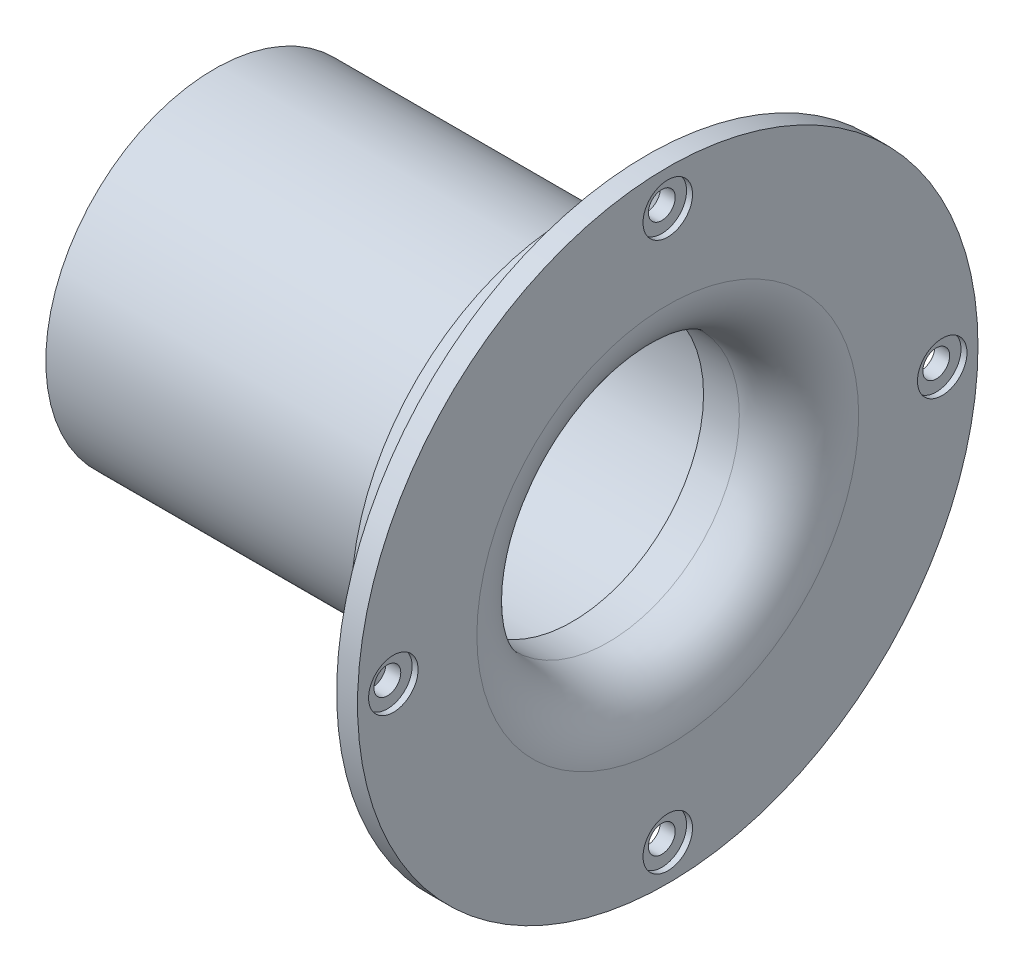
ISO-10303-21;
HEADER;
FILE_DESCRIPTION(('STEP AP214'),'2;1');
FILE_NAME('part.step','',(''),(''),'','','');
FILE_SCHEMA(('AUTOMOTIVE_DESIGN { 1 0 10303 214 1 1 1 1 }'));
ENDSEC;
DATA;
#1=APPLICATION_CONTEXT('core data for automotive mechanical design processes');
#2=APPLICATION_PROTOCOL_DEFINITION('international standard','automotive_design',2000,#1);
#3=PRODUCT_CONTEXT('',#1,'mechanical');
#4=PRODUCT('Part','Part','',(#3));
#5=PRODUCT_RELATED_PRODUCT_CATEGORY('part','',(#4));
#6=PRODUCT_DEFINITION_FORMATION('','',#4);
#7=PRODUCT_DEFINITION_CONTEXT('part definition',#1,'design');
#8=PRODUCT_DEFINITION('design','',#6,#7);
#9=PRODUCT_DEFINITION_SHAPE('','',#8);
#10=(LENGTH_UNIT() NAMED_UNIT(*) SI_UNIT(.MILLI.,.METRE.));
#11=(NAMED_UNIT(*) PLANE_ANGLE_UNIT() SI_UNIT($,.RADIAN.));
#12=(NAMED_UNIT(*) SI_UNIT($,.STERADIAN.) SOLID_ANGLE_UNIT());
#13=UNCERTAINTY_MEASURE_WITH_UNIT(LENGTH_MEASURE(1.E-05),#10,'distance_accuracy_value','');
#14=(GEOMETRIC_REPRESENTATION_CONTEXT(3) GLOBAL_UNCERTAINTY_ASSIGNED_CONTEXT((#13)) GLOBAL_UNIT_ASSIGNED_CONTEXT((#10,
#11,#12)) REPRESENTATION_CONTEXT('',''));
#15=CARTESIAN_POINT('',(0.,0.,0.));
#16=DIRECTION('',(0.,0.,1.));
#17=DIRECTION('',(1.,0.,0.));
#18=AXIS2_PLACEMENT_3D('',#15,#16,#17);
#19=CARTESIAN_POINT('',(-3.5,-46.,4.81824703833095E-13));
#20=DIRECTION('',(1.,0.,0.));
#21=DIRECTION('',(0.,0.,-1.));
#22=AXIS2_PLACEMENT_3D('',#19,#20,#21);
#23=CYLINDRICAL_SURFACE('',#22,2.25);
#24=CARTESIAN_POINT('',(-3.5,-46.,4.81824703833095E-13));
#25=DIRECTION('',(1.,0.,0.));
#26=DIRECTION('',(0.,0.,-1.));
#27=AXIS2_PLACEMENT_3D('',#24,#25,#26);
#28=CIRCLE('',#27,2.25);
#29=CARTESIAN_POINT('',(-3.5,-46.,-2.24999999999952));
#30=VERTEX_POINT('',#29);
#31=EDGE_CURVE('E51',#30,#30,#28,.T.);
#32=ORIENTED_EDGE('',*,*,#31,.F.);
#33=EDGE_LOOP('',(#32));
#34=FACE_BOUND('',#33,.T.);
#35=CARTESIAN_POINT('',(-1.,-46.,4.81824703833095E-13));
#36=DIRECTION('',(1.,0.,0.));
#37=DIRECTION('',(0.,0.,-1.));
#38=AXIS2_PLACEMENT_3D('',#35,#36,#37);
#39=CIRCLE('',#38,2.25);
#40=CARTESIAN_POINT('',(-1.,-46.,-2.24999999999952));
#41=VERTEX_POINT('',#40);
#42=EDGE_CURVE('E35',#41,#41,#39,.F.);
#43=ORIENTED_EDGE('',*,*,#42,.F.);
#44=EDGE_LOOP('',(#43));
#45=FACE_BOUND('',#44,.T.);
#46=ADVANCED_FACE('F31',(#34,#45),#23,.F.);
#47=CARTESIAN_POINT('',(-3.5,-3.21216469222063E-13,-46.));
#48=DIRECTION('',(1.,0.,0.));
#49=DIRECTION('',(0.,0.,-1.));
#50=AXIS2_PLACEMENT_3D('',#47,#48,#49);
#51=CYLINDRICAL_SURFACE('',#50,2.25);
#52=CARTESIAN_POINT('',(-3.5,-3.21216469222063E-13,-46.));
#53=DIRECTION('',(1.,0.,0.));
#54=DIRECTION('',(0.,0.,-1.));
#55=AXIS2_PLACEMENT_3D('',#52,#53,#54);
#56=CIRCLE('',#55,2.25);
#57=CARTESIAN_POINT('',(-3.5,-3.21216469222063E-13,-48.25));
#58=VERTEX_POINT('',#57);
#59=EDGE_CURVE('E84',#58,#58,#56,.T.);
#60=ORIENTED_EDGE('',*,*,#59,.F.);
#61=EDGE_LOOP('',(#60));
#62=FACE_BOUND('',#61,.T.);
#63=CARTESIAN_POINT('',(-1.,-3.21216469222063E-13,-46.));
#64=DIRECTION('',(1.,0.,0.));
#65=DIRECTION('',(0.,0.,-1.));
#66=AXIS2_PLACEMENT_3D('',#63,#64,#65);
#67=CIRCLE('',#66,2.25);
#68=CARTESIAN_POINT('',(-1.,-3.21216469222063E-13,-48.25));
#69=VERTEX_POINT('',#68);
#70=EDGE_CURVE('E57',#69,#69,#67,.F.);
#71=ORIENTED_EDGE('',*,*,#70,.F.);
#72=EDGE_LOOP('',(#71));
#73=FACE_BOUND('',#72,.T.);
#74=ADVANCED_FACE('F138',(#62,#73),#51,.F.);
#75=CARTESIAN_POINT('',(-3.5,46.,-1.60608234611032E-13));
#76=DIRECTION('',(1.,0.,0.));
#77=DIRECTION('',(0.,0.,-1.));
#78=AXIS2_PLACEMENT_3D('',#75,#76,#77);
#79=CYLINDRICAL_SURFACE('',#78,2.25);
#80=CARTESIAN_POINT('',(-3.5,46.,-1.60608234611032E-13));
#81=DIRECTION('',(1.,0.,0.));
#82=DIRECTION('',(0.,0.,-1.));
#83=AXIS2_PLACEMENT_3D('',#80,#81,#82);
#84=CIRCLE('',#83,2.25);
#85=CARTESIAN_POINT('',(-3.5,46.,-2.25000000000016));
#86=VERTEX_POINT('',#85);
#87=EDGE_CURVE('E87',#86,#86,#84,.T.);
#88=ORIENTED_EDGE('',*,*,#87,.F.);
#89=EDGE_LOOP('',(#88));
#90=FACE_BOUND('',#89,.T.);
#91=CARTESIAN_POINT('',(-1.,46.,-1.60608234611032E-13));
#92=DIRECTION('',(1.,0.,0.));
#93=DIRECTION('',(0.,0.,-1.));
#94=AXIS2_PLACEMENT_3D('',#91,#92,#93);
#95=CIRCLE('',#94,2.25);
#96=CARTESIAN_POINT('',(-1.,46.,-2.25000000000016));
#97=VERTEX_POINT('',#96);
#98=EDGE_CURVE('E53',#97,#97,#95,.F.);
#99=ORIENTED_EDGE('',*,*,#98,.F.);
#100=EDGE_LOOP('',(#99));
#101=FACE_BOUND('',#100,.T.);
#102=ADVANCED_FACE('F144',(#90,#101),#79,.F.);
#103=CARTESIAN_POINT('',(-3.5,0.,46.));
#104=DIRECTION('',(1.,0.,0.));
#105=DIRECTION('',(0.,0.,-1.));
#106=AXIS2_PLACEMENT_3D('',#103,#104,#105);
#107=CYLINDRICAL_SURFACE('',#106,2.25);
#108=CARTESIAN_POINT('',(-3.5,0.,46.));
#109=DIRECTION('',(1.,0.,0.));
#110=DIRECTION('',(0.,0.,-1.));
#111=AXIS2_PLACEMENT_3D('',#108,#109,#110);
#112=CIRCLE('',#111,2.25);
#113=CARTESIAN_POINT('',(-3.5,0.,43.75));
#114=VERTEX_POINT('',#113);
#115=EDGE_CURVE('E90',#114,#114,#112,.T.);
#116=ORIENTED_EDGE('',*,*,#115,.F.);
#117=EDGE_LOOP('',(#116));
#118=FACE_BOUND('',#117,.T.);
#119=CARTESIAN_POINT('',(-1.,0.,46.));
#120=DIRECTION('',(1.,0.,0.));
#121=DIRECTION('',(0.,0.,-1.));
#122=AXIS2_PLACEMENT_3D('',#119,#120,#121);
#123=CIRCLE('',#122,2.25);
#124=CARTESIAN_POINT('',(-1.,0.,43.75));
#125=VERTEX_POINT('',#124);
#126=EDGE_CURVE('E48',#125,#125,#123,.F.);
#127=ORIENTED_EDGE('',*,*,#126,.F.);
#128=EDGE_LOOP('',(#127));
#129=FACE_BOUND('',#128,.T.);
#130=ADVANCED_FACE('F155',(#118,#129),#107,.F.);
#131=CARTESIAN_POINT('',(-10.,0.,0.));
#132=DIRECTION('',(1.,0.,0.));
#133=DIRECTION('',(0.,0.,-1.));
#134=AXIS2_PLACEMENT_3D('',#131,#132,#133);
#135=TOROIDAL_SURFACE('',#134,32.,10.);
#136=CARTESIAN_POINT('',(-10.0000000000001,0.,0.));
#137=DIRECTION('',(1.,0.,0.));
#138=DIRECTION('',(0.,0.,-1.));
#139=AXIS2_PLACEMENT_3D('',#136,#137,#138);
#140=CIRCLE('',#139,22.);
#141=CARTESIAN_POINT('',(-10.0000000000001,0.,-22.));
#142=VERTEX_POINT('',#141);
#143=EDGE_CURVE('E93',#142,#142,#140,.T.);
#144=ORIENTED_EDGE('',*,*,#143,.F.);
#145=EDGE_LOOP('',(#144));
#146=FACE_BOUND('',#145,.T.);
#147=CARTESIAN_POINT('',(0.,0.,0.));
#148=DIRECTION('',(1.,0.,0.));
#149=DIRECTION('',(0.,0.,-1.));
#150=AXIS2_PLACEMENT_3D('',#147,#148,#149);
#151=CIRCLE('',#150,32.0000000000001);
#152=CARTESIAN_POINT('',(0.,0.,-32.0000000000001));
#153=VERTEX_POINT('',#152);
#154=EDGE_CURVE('E10',#153,#153,#151,.T.);
#155=ORIENTED_EDGE('',*,*,#154,.T.);
#156=EDGE_LOOP('',(#155));
#157=FACE_BOUND('',#156,.T.);
#158=ADVANCED_FACE('F33',(#146,#157),#135,.T.);
#159=CARTESIAN_POINT('',(0.,0.,-32.6524702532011));
#160=DIRECTION('',(-1.,0.,0.));
#161=DIRECTION('',(0.,0.,1.));
#162=AXIS2_PLACEMENT_3D('',#159,#160,#161);
#163=PLANE('',#162);
#164=CARTESIAN_POINT('',(0.,-46.,4.81824703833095E-13));
#165=DIRECTION('',(1.,0.,0.));
#166=DIRECTION('',(0.,0.,-1.));
#167=AXIS2_PLACEMENT_3D('',#164,#165,#166);
#168=CIRCLE('',#167,4.15);
#169=CARTESIAN_POINT('',(0.,-46.,-4.14999999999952));
#170=VERTEX_POINT('',#169);
#171=EDGE_CURVE('E73',#170,#170,#168,.T.);
#172=ORIENTED_EDGE('',*,*,#171,.F.);
#173=EDGE_LOOP('',(#172));
#174=FACE_BOUND('',#173,.T.);
#175=CARTESIAN_POINT('',(0.,-3.21216469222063E-13,-46.));
#176=DIRECTION('',(1.,0.,0.));
#177=DIRECTION('',(0.,0.,-1.));
#178=AXIS2_PLACEMENT_3D('',#175,#176,#177);
#179=CIRCLE('',#178,4.15);
#180=CARTESIAN_POINT('',(0.,-3.21216469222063E-13,-50.15));
#181=VERTEX_POINT('',#180);
#182=EDGE_CURVE('E66',#181,#181,#179,.T.);
#183=ORIENTED_EDGE('',*,*,#182,.F.);
#184=EDGE_LOOP('',(#183));
#185=FACE_BOUND('',#184,.T.);
#186=CARTESIAN_POINT('',(0.,46.,-1.60608234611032E-13));
#187=DIRECTION('',(1.,0.,0.));
#188=DIRECTION('',(0.,0.,-1.));
#189=AXIS2_PLACEMENT_3D('',#186,#187,#188);
#190=CIRCLE('',#189,4.15);
#191=CARTESIAN_POINT('',(0.,46.,-4.15000000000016));
#192=VERTEX_POINT('',#191);
#193=EDGE_CURVE('E59',#192,#192,#190,.T.);
#194=ORIENTED_EDGE('',*,*,#193,.F.);
#195=EDGE_LOOP('',(#194));
#196=FACE_BOUND('',#195,.T.);
#197=CARTESIAN_POINT('',(0.,0.,46.));
#198=DIRECTION('',(1.,0.,0.));
#199=DIRECTION('',(0.,0.,-1.));
#200=AXIS2_PLACEMENT_3D('',#197,#198,#199);
#201=CIRCLE('',#200,4.15);
#202=CARTESIAN_POINT('',(0.,0.,41.85));
#203=VERTEX_POINT('',#202);
#204=EDGE_CURVE('E55',#203,#203,#201,.T.);
#205=ORIENTED_EDGE('',*,*,#204,.F.);
#206=EDGE_LOOP('',(#205));
#207=FACE_BOUND('',#206,.T.);
#208=ORIENTED_EDGE('',*,*,#154,.F.);
#209=EDGE_LOOP('',(#208));
#210=FACE_BOUND('',#209,.T.);
#211=CARTESIAN_POINT('',(0.,0.,0.));
#212=DIRECTION('',(1.,0.,0.));
#213=DIRECTION('',(0.,0.,-1.));
#214=AXIS2_PLACEMENT_3D('',#211,#212,#213);
#215=CIRCLE('',#214,52.);
#216=CARTESIAN_POINT('',(0.,0.,-52.));
#217=VERTEX_POINT('',#216);
#218=EDGE_CURVE('E39',#217,#217,#215,.T.);
#219=ORIENTED_EDGE('',*,*,#218,.T.);
#220=EDGE_LOOP('',(#219));
#221=FACE_BOUND('',#220,.T.);
#222=ADVANCED_FACE('F134',(#174,#185,#196,#207,#210,#221),#163,.F.);
#223=CARTESIAN_POINT('',(0.,0.,0.));
#224=DIRECTION('',(1.,0.,0.));
#225=DIRECTION('',(0.,0.,-1.));
#226=AXIS2_PLACEMENT_3D('',#223,#224,#225);
#227=CYLINDRICAL_SURFACE('',#226,52.);
#228=CARTESIAN_POINT('',(-3.5,0.,0.));
#229=DIRECTION('',(1.,0.,0.));
#230=DIRECTION('',(0.,0.,-1.));
#231=AXIS2_PLACEMENT_3D('',#228,#229,#230);
#232=CIRCLE('',#231,52.);
#233=CARTESIAN_POINT('',(-3.5,0.,-52.));
#234=VERTEX_POINT('',#233);
#235=EDGE_CURVE('E44',#234,#234,#232,.T.);
#236=ORIENTED_EDGE('',*,*,#235,.T.);
#237=EDGE_LOOP('',(#236));
#238=FACE_BOUND('',#237,.T.);
#239=ORIENTED_EDGE('',*,*,#218,.F.);
#240=EDGE_LOOP('',(#239));
#241=FACE_BOUND('',#240,.T.);
#242=ADVANCED_FACE('F119',(#238,#241),#227,.T.);
#243=CARTESIAN_POINT('',(-3.5,0.,-32.6524702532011));
#244=DIRECTION('',(-1.,0.,0.));
#245=DIRECTION('',(0.,0.,1.));
#246=AXIS2_PLACEMENT_3D('',#243,#244,#245);
#247=PLANE('',#246);
#248=ORIENTED_EDGE('',*,*,#31,.T.);
#249=EDGE_LOOP('',(#248));
#250=FACE_BOUND('',#249,.T.);
#251=ORIENTED_EDGE('',*,*,#59,.T.);
#252=EDGE_LOOP('',(#251));
#253=FACE_BOUND('',#252,.T.);
#254=ORIENTED_EDGE('',*,*,#87,.T.);
#255=EDGE_LOOP('',(#254));
#256=FACE_BOUND('',#255,.T.);
#257=ORIENTED_EDGE('',*,*,#115,.T.);
#258=EDGE_LOOP('',(#257));
#259=FACE_BOUND('',#258,.T.);
#260=CARTESIAN_POINT('',(-3.5,0.,0.));
#261=DIRECTION('',(1.,0.,0.));
#262=DIRECTION('',(0.,0.,-1.));
#263=AXIS2_PLACEMENT_3D('',#260,#261,#262);
#264=CIRCLE('',#263,37.);
#265=CARTESIAN_POINT('',(-3.5,0.,-37.));
#266=VERTEX_POINT('',#265);
#267=EDGE_CURVE('E114',#266,#266,#264,.T.);
#268=ORIENTED_EDGE('',*,*,#267,.T.);
#269=EDGE_LOOP('',(#268));
#270=FACE_BOUND('',#269,.T.);
#271=ORIENTED_EDGE('',*,*,#235,.F.);
#272=EDGE_LOOP('',(#271));
#273=FACE_BOUND('',#272,.T.);
#274=ADVANCED_FACE('F122',(#250,#253,#256,#259,#270,#273),#247,.T.);
#275=CARTESIAN_POINT('',(0.,0.,0.));
#276=DIRECTION('',(1.,0.,0.));
#277=DIRECTION('',(0.,0.,-1.));
#278=AXIS2_PLACEMENT_3D('',#275,#276,#277);
#279=CYLINDRICAL_SURFACE('',#278,37.);
#280=ORIENTED_EDGE('',*,*,#267,.F.);
#281=EDGE_LOOP('',(#280));
#282=FACE_BOUND('',#281,.T.);
#283=CARTESIAN_POINT('',(-16.,0.,0.));
#284=DIRECTION('',(1.,0.,0.));
#285=DIRECTION('',(0.,0.,-1.));
#286=AXIS2_PLACEMENT_3D('',#283,#284,#285);
#287=CIRCLE('',#286,37.);
#288=CARTESIAN_POINT('',(-16.,0.,-37.));
#289=VERTEX_POINT('',#288);
#290=EDGE_CURVE('E111',#289,#289,#287,.T.);
#291=ORIENTED_EDGE('',*,*,#290,.T.);
#292=EDGE_LOOP('',(#291));
#293=FACE_BOUND('',#292,.T.);
#294=ADVANCED_FACE('F124',(#282,#293),#279,.T.);
#295=CARTESIAN_POINT('',(-16.,0.,-32.6524702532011));
#296=DIRECTION('',(1.,0.,0.));
#297=DIRECTION('',(0.,0.,-1.));
#298=AXIS2_PLACEMENT_3D('',#295,#296,#297);
#299=PLANE('',#298);
#300=ORIENTED_EDGE('',*,*,#290,.F.);
#301=EDGE_LOOP('',(#300));
#302=FACE_BOUND('',#301,.T.);
#303=CARTESIAN_POINT('',(-16.,0.,0.));
#304=DIRECTION('',(1.,0.,0.));
#305=DIRECTION('',(0.,0.,-1.));
#306=AXIS2_PLACEMENT_3D('',#303,#304,#305);
#307=CIRCLE('',#306,28.25);
#308=CARTESIAN_POINT('',(-16.,0.,-28.25));
#309=VERTEX_POINT('',#308);
#310=EDGE_CURVE('E108',#309,#309,#307,.T.);
#311=ORIENTED_EDGE('',*,*,#310,.T.);
#312=EDGE_LOOP('',(#311));
#313=FACE_BOUND('',#312,.T.);
#314=ADVANCED_FACE('F131',(#302,#313),#299,.F.);
#315=CARTESIAN_POINT('',(0.,0.,0.));
#316=DIRECTION('',(1.,0.,0.));
#317=DIRECTION('',(0.,0.,-1.));
#318=AXIS2_PLACEMENT_3D('',#315,#316,#317);
#319=CYLINDRICAL_SURFACE('',#318,28.25);
#320=ORIENTED_EDGE('',*,*,#310,.F.);
#321=EDGE_LOOP('',(#320));
#322=FACE_BOUND('',#321,.T.);
#323=CARTESIAN_POINT('',(-76.,0.,0.));
#324=DIRECTION('',(1.,0.,0.));
#325=DIRECTION('',(0.,0.,-1.));
#326=AXIS2_PLACEMENT_3D('',#323,#324,#325);
#327=CIRCLE('',#326,28.25);
#328=CARTESIAN_POINT('',(-76.,0.,-28.25));
#329=VERTEX_POINT('',#328);
#330=EDGE_CURVE('E105',#329,#329,#327,.T.);
#331=ORIENTED_EDGE('',*,*,#330,.T.);
#332=EDGE_LOOP('',(#331));
#333=FACE_BOUND('',#332,.T.);
#334=ADVANCED_FACE('F176',(#322,#333),#319,.T.);
#335=CARTESIAN_POINT('',(-76.,0.,-32.6524702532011));
#336=DIRECTION('',(-1.,0.,0.));
#337=DIRECTION('',(0.,0.,1.));
#338=AXIS2_PLACEMENT_3D('',#335,#336,#337);
#339=PLANE('',#338);
#340=CARTESIAN_POINT('',(-76.,0.,0.));
#341=DIRECTION('',(1.,0.,0.));
#342=DIRECTION('',(0.,0.,-1.));
#343=AXIS2_PLACEMENT_3D('',#340,#341,#342);
#344=CIRCLE('',#343,25.25);
#345=CARTESIAN_POINT('',(-76.,0.,-25.25));
#346=VERTEX_POINT('',#345);
#347=EDGE_CURVE('E102',#346,#346,#344,.T.);
#348=ORIENTED_EDGE('',*,*,#347,.T.);
#349=EDGE_LOOP('',(#348));
#350=FACE_BOUND('',#349,.T.);
#351=ORIENTED_EDGE('',*,*,#330,.F.);
#352=EDGE_LOOP('',(#351));
#353=FACE_BOUND('',#352,.T.);
#354=ADVANCED_FACE('F172',(#350,#353),#339,.T.);
#355=CARTESIAN_POINT('',(0.,0.,0.));
#356=DIRECTION('',(1.,0.,0.));
#357=DIRECTION('',(0.,0.,-1.));
#358=AXIS2_PLACEMENT_3D('',#355,#356,#357);
#359=CYLINDRICAL_SURFACE('',#358,25.25);
#360=CARTESIAN_POINT('',(-16.,0.,0.));
#361=DIRECTION('',(1.,0.,0.));
#362=DIRECTION('',(0.,0.,-1.));
#363=AXIS2_PLACEMENT_3D('',#360,#361,#362);
#364=CIRCLE('',#363,25.25);
#365=CARTESIAN_POINT('',(-16.,0.,-25.25));
#366=VERTEX_POINT('',#365);
#367=EDGE_CURVE('E99',#366,#366,#364,.T.);
#368=ORIENTED_EDGE('',*,*,#367,.T.);
#369=EDGE_LOOP('',(#368));
#370=FACE_BOUND('',#369,.T.);
#371=ORIENTED_EDGE('',*,*,#347,.F.);
#372=EDGE_LOOP('',(#371));
#373=FACE_BOUND('',#372,.T.);
#374=ADVANCED_FACE('F168',(#370,#373),#359,.F.);
#375=CARTESIAN_POINT('',(-16.,0.,-32.652470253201));
#376=DIRECTION('',(-1.,0.,0.));
#377=DIRECTION('',(0.,0.,1.));
#378=AXIS2_PLACEMENT_3D('',#375,#376,#377);
#379=PLANE('',#378);
#380=CARTESIAN_POINT('',(-16.,0.,0.));
#381=DIRECTION('',(1.,0.,0.));
#382=DIRECTION('',(0.,0.,-1.));
#383=AXIS2_PLACEMENT_3D('',#380,#381,#382);
#384=CIRCLE('',#383,22.);
#385=CARTESIAN_POINT('',(-16.,0.,-22.));
#386=VERTEX_POINT('',#385);
#387=EDGE_CURVE('E96',#386,#386,#384,.T.);
#388=ORIENTED_EDGE('',*,*,#387,.T.);
#389=EDGE_LOOP('',(#388));
#390=FACE_BOUND('',#389,.T.);
#391=ORIENTED_EDGE('',*,*,#367,.F.);
#392=EDGE_LOOP('',(#391));
#393=FACE_BOUND('',#392,.T.);
#394=ADVANCED_FACE('F164',(#390,#393),#379,.T.);
#395=CARTESIAN_POINT('',(0.,0.,0.));
#396=DIRECTION('',(1.,0.,0.));
#397=DIRECTION('',(0.,0.,-1.));
#398=AXIS2_PLACEMENT_3D('',#395,#396,#397);
#399=CYLINDRICAL_SURFACE('',#398,22.);
#400=ORIENTED_EDGE('',*,*,#143,.T.);
#401=EDGE_LOOP('',(#400));
#402=FACE_BOUND('',#401,.T.);
#403=ORIENTED_EDGE('',*,*,#387,.F.);
#404=EDGE_LOOP('',(#403));
#405=FACE_BOUND('',#404,.T.);
#406=ADVANCED_FACE('F160',(#402,#405),#399,.F.);
#407=CARTESIAN_POINT('',(-1.,0.,46.));
#408=DIRECTION('',(1.,0.,0.));
#409=DIRECTION('',(0.,0.,-1.));
#410=AXIS2_PLACEMENT_3D('',#407,#408,#409);
#411=PLANE('',#410);
#412=CARTESIAN_POINT('',(-1.,0.,46.));
#413=DIRECTION('',(1.,0.,0.));
#414=DIRECTION('',(0.,0.,-1.));
#415=AXIS2_PLACEMENT_3D('',#412,#413,#414);
#416=CIRCLE('',#415,4.15);
#417=CARTESIAN_POINT('',(-1.,0.,41.85));
#418=VERTEX_POINT('',#417);
#419=EDGE_CURVE('E52',#418,#418,#416,.T.);
#420=ORIENTED_EDGE('',*,*,#419,.T.);
#421=EDGE_LOOP('',(#420));
#422=FACE_BOUND('',#421,.T.);
#423=ORIENTED_EDGE('',*,*,#126,.T.);
#424=EDGE_LOOP('',(#423));
#425=FACE_BOUND('',#424,.T.);
#426=ADVANCED_FACE('F163',(#422,#425),#411,.T.);
#427=CARTESIAN_POINT('',(-1.,0.,46.));
#428=DIRECTION('',(1.,0.,0.));
#429=DIRECTION('',(0.,0.,-1.));
#430=AXIS2_PLACEMENT_3D('',#427,#428,#429);
#431=CYLINDRICAL_SURFACE('',#430,4.15);
#432=ORIENTED_EDGE('',*,*,#419,.F.);
#433=EDGE_LOOP('',(#432));
#434=FACE_BOUND('',#433,.T.);
#435=ORIENTED_EDGE('',*,*,#204,.T.);
#436=EDGE_LOOP('',(#435));
#437=FACE_BOUND('',#436,.T.);
#438=ADVANCED_FACE('F150',(#434,#437),#431,.F.);
#439=CARTESIAN_POINT('',(-1.,46.,-1.60608234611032E-13));
#440=DIRECTION('',(1.,0.,0.));
#441=DIRECTION('',(0.,0.,-1.));
#442=AXIS2_PLACEMENT_3D('',#439,#440,#441);
#443=PLANE('',#442);
#444=CARTESIAN_POINT('',(-1.,46.,-1.60608234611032E-13));
#445=DIRECTION('',(1.,0.,0.));
#446=DIRECTION('',(0.,0.,-1.));
#447=AXIS2_PLACEMENT_3D('',#444,#445,#446);
#448=CIRCLE('',#447,4.15);
#449=CARTESIAN_POINT('',(-1.,46.,-4.15000000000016));
#450=VERTEX_POINT('',#449);
#451=EDGE_CURVE('E56',#450,#450,#448,.T.);
#452=ORIENTED_EDGE('',*,*,#451,.T.);
#453=EDGE_LOOP('',(#452));
#454=FACE_BOUND('',#453,.T.);
#455=ORIENTED_EDGE('',*,*,#98,.T.);
#456=EDGE_LOOP('',(#455));
#457=FACE_BOUND('',#456,.T.);
#458=ADVANCED_FACE('F227',(#454,#457),#443,.T.);
#459=CARTESIAN_POINT('',(-1.,46.,-1.60608234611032E-13));
#460=DIRECTION('',(1.,0.,0.));
#461=DIRECTION('',(0.,0.,-1.));
#462=AXIS2_PLACEMENT_3D('',#459,#460,#461);
#463=CYLINDRICAL_SURFACE('',#462,4.15);
#464=ORIENTED_EDGE('',*,*,#451,.F.);
#465=EDGE_LOOP('',(#464));
#466=FACE_BOUND('',#465,.T.);
#467=ORIENTED_EDGE('',*,*,#193,.T.);
#468=EDGE_LOOP('',(#467));
#469=FACE_BOUND('',#468,.T.);
#470=ADVANCED_FACE('F234',(#466,#469),#463,.F.);
#471=CARTESIAN_POINT('',(-1.,-3.21216469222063E-13,-46.));
#472=DIRECTION('',(1.,0.,0.));
#473=DIRECTION('',(0.,0.,-1.));
#474=AXIS2_PLACEMENT_3D('',#471,#472,#473);
#475=PLANE('',#474);
#476=CARTESIAN_POINT('',(-1.,-3.21216469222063E-13,-46.));
#477=DIRECTION('',(1.,0.,0.));
#478=DIRECTION('',(0.,0.,-1.));
#479=AXIS2_PLACEMENT_3D('',#476,#477,#478);
#480=CIRCLE('',#479,4.15);
#481=CARTESIAN_POINT('',(-1.,-3.21216469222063E-13,-50.15));
#482=VERTEX_POINT('',#481);
#483=EDGE_CURVE('E60',#482,#482,#480,.T.);
#484=ORIENTED_EDGE('',*,*,#483,.T.);
#485=EDGE_LOOP('',(#484));
#486=FACE_BOUND('',#485,.T.);
#487=ORIENTED_EDGE('',*,*,#70,.T.);
#488=EDGE_LOOP('',(#487));
#489=FACE_BOUND('',#488,.T.);
#490=ADVANCED_FACE('F242',(#486,#489),#475,.T.);
#491=CARTESIAN_POINT('',(-1.,-3.21216469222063E-13,-46.));
#492=DIRECTION('',(1.,0.,0.));
#493=DIRECTION('',(0.,0.,-1.));
#494=AXIS2_PLACEMENT_3D('',#491,#492,#493);
#495=CYLINDRICAL_SURFACE('',#494,4.15);
#496=ORIENTED_EDGE('',*,*,#483,.F.);
#497=EDGE_LOOP('',(#496));
#498=FACE_BOUND('',#497,.T.);
#499=ORIENTED_EDGE('',*,*,#182,.T.);
#500=EDGE_LOOP('',(#499));
#501=FACE_BOUND('',#500,.T.);
#502=ADVANCED_FACE('F250',(#498,#501),#495,.F.);
#503=CARTESIAN_POINT('',(-1.,-46.,4.81824703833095E-13));
#504=DIRECTION('',(1.,0.,0.));
#505=DIRECTION('',(0.,0.,-1.));
#506=AXIS2_PLACEMENT_3D('',#503,#504,#505);
#507=PLANE('',#506);
#508=CARTESIAN_POINT('',(-1.,-46.,4.81824703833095E-13));
#509=DIRECTION('',(1.,0.,0.));
#510=DIRECTION('',(0.,0.,-1.));
#511=AXIS2_PLACEMENT_3D('',#508,#509,#510);
#512=CIRCLE('',#511,4.15);
#513=CARTESIAN_POINT('',(-1.,-46.,-4.14999999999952));
#514=VERTEX_POINT('',#513);
#515=EDGE_CURVE('E377',#514,#514,#512,.T.);
#516=ORIENTED_EDGE('',*,*,#515,.T.);
#517=EDGE_LOOP('',(#516));
#518=FACE_BOUND('',#517,.T.);
#519=ORIENTED_EDGE('',*,*,#42,.T.);
#520=EDGE_LOOP('',(#519));
#521=FACE_BOUND('',#520,.T.);
#522=ADVANCED_FACE('F257',(#518,#521),#507,.T.);
#523=CARTESIAN_POINT('',(-1.,-46.,4.81824703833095E-13));
#524=DIRECTION('',(1.,0.,0.));
#525=DIRECTION('',(0.,0.,-1.));
#526=AXIS2_PLACEMENT_3D('',#523,#524,#525);
#527=CYLINDRICAL_SURFACE('',#526,4.15);
#528=ORIENTED_EDGE('',*,*,#515,.F.);
#529=EDGE_LOOP('',(#528));
#530=FACE_BOUND('',#529,.T.);
#531=ORIENTED_EDGE('',*,*,#171,.T.);
#532=EDGE_LOOP('',(#531));
#533=FACE_BOUND('',#532,.T.);
#534=ADVANCED_FACE('F265',(#530,#533),#527,.F.);
#535=CLOSED_SHELL('',(#46,#74,#102,#130,#158,#222,#242,#274,#294,#314,#334,#354,#374,#394,#406,
#426,#438,#458,#470,#490,#502,#522,#534));
#536=MANIFOLD_SOLID_BREP('B2',#535);
#537=ADVANCED_BREP_SHAPE_REPRESENTATION('',(#18,#536),#14);
#538=SHAPE_DEFINITION_REPRESENTATION(#9,#537);
ENDSEC;
END-ISO-10303-21;
